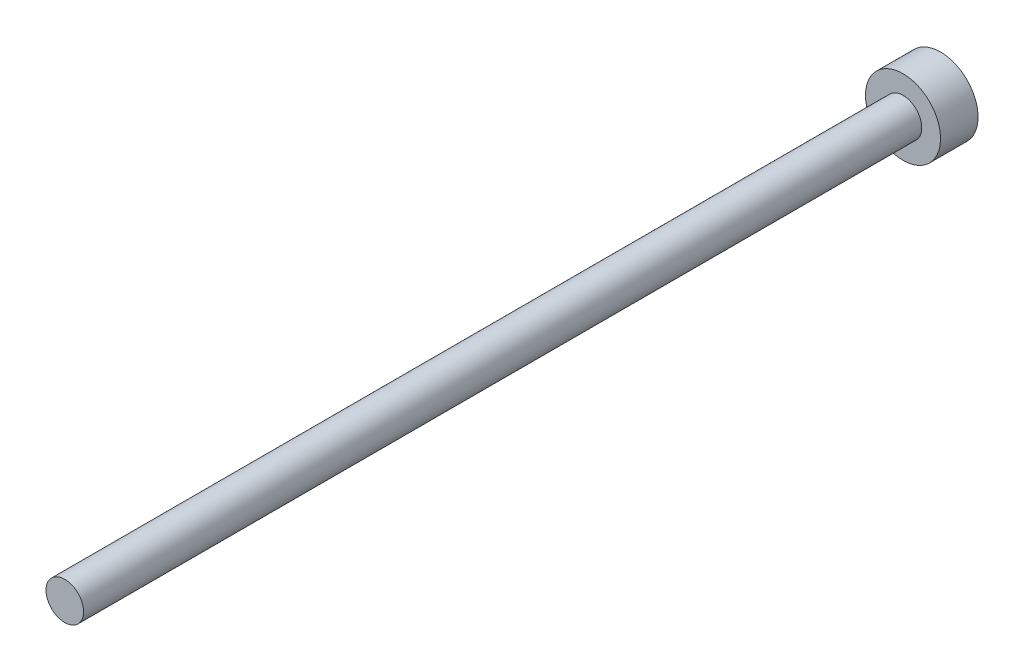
ISO-10303-21;
HEADER;
FILE_DESCRIPTION(('STEP AP214'),'2;1');
FILE_NAME('part.step','',(''),(''),'','','');
FILE_SCHEMA(('AUTOMOTIVE_DESIGN { 1 0 10303 214 1 1 1 1 }'));
ENDSEC;
DATA;
#1=APPLICATION_CONTEXT('core data for automotive mechanical design processes');
#2=APPLICATION_PROTOCOL_DEFINITION('international standard','automotive_design',2000,#1);
#3=PRODUCT_CONTEXT('',#1,'mechanical');
#4=PRODUCT('Part','Part','',(#3));
#5=PRODUCT_RELATED_PRODUCT_CATEGORY('part','',(#4));
#6=PRODUCT_DEFINITION_FORMATION('','',#4);
#7=PRODUCT_DEFINITION_CONTEXT('part definition',#1,'design');
#8=PRODUCT_DEFINITION('design','',#6,#7);
#9=PRODUCT_DEFINITION_SHAPE('','',#8);
#10=(LENGTH_UNIT() NAMED_UNIT(*) SI_UNIT(.MILLI.,.METRE.));
#11=(NAMED_UNIT(*) PLANE_ANGLE_UNIT() SI_UNIT($,.RADIAN.));
#12=(NAMED_UNIT(*) SI_UNIT($,.STERADIAN.) SOLID_ANGLE_UNIT());
#13=UNCERTAINTY_MEASURE_WITH_UNIT(LENGTH_MEASURE(1.E-05),#10,'distance_accuracy_value','');
#14=(GEOMETRIC_REPRESENTATION_CONTEXT(3) GLOBAL_UNCERTAINTY_ASSIGNED_CONTEXT((#13)) GLOBAL_UNIT_ASSIGNED_CONTEXT((#10,
#11,#12)) REPRESENTATION_CONTEXT('',''));
#15=CARTESIAN_POINT('',(0.,0.,0.));
#16=DIRECTION('',(0.,0.,1.));
#17=DIRECTION('',(1.,0.,0.));
#18=AXIS2_PLACEMENT_3D('',#15,#16,#17);
#19=CARTESIAN_POINT('',(0.,0.,3.));
#20=DIRECTION('',(0.,0.,0.999999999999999));
#21=DIRECTION('',(1.,0.,0.));
#22=AXIS2_PLACEMENT_3D('',#19,#20,#21);
#23=PLANE('',#22);
#24=CARTESIAN_POINT('',(0.,0.,3.));
#25=DIRECTION('',(0.,0.,0.999999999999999));
#26=DIRECTION('',(1.,0.,0.));
#27=AXIS2_PLACEMENT_3D('',#24,#25,#26);
#28=CIRCLE('',#27,3.);
#29=CARTESIAN_POINT('',(-3.,0.,3.));
#30=VERTEX_POINT('',#29);
#31=EDGE_CURVE('E10',#30,#30,#28,.T.);
#32=ORIENTED_EDGE('',*,*,#31,.T.);
#33=EDGE_LOOP('',(#32));
#34=FACE_BOUND('',#33,.T.);
#35=CARTESIAN_POINT('',(0.,0.,3.));
#36=DIRECTION('',(0.,0.,0.999999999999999));
#37=DIRECTION('',(1.,0.,0.));
#38=AXIS2_PLACEMENT_3D('',#35,#36,#37);
#39=CIRCLE('',#38,1.5);
#40=CARTESIAN_POINT('',(-1.50000000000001,0.,3.));
#41=VERTEX_POINT('',#40);
#42=EDGE_CURVE('E52',#41,#41,#39,.T.);
#43=ORIENTED_EDGE('',*,*,#42,.F.);
#44=EDGE_LOOP('',(#43));
#45=FACE_BOUND('',#44,.T.);
#46=ADVANCED_FACE('F36',(#34,#45),#23,.T.);
#47=CARTESIAN_POINT('',(0.,0.,3.));
#48=DIRECTION('',(0.,0.,-0.999999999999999));
#49=DIRECTION('',(-1.,0.,0.));
#50=AXIS2_PLACEMENT_3D('',#47,#48,#49);
#51=CYLINDRICAL_SURFACE('',#50,3.);
#52=CARTESIAN_POINT('',(0.,0.,0.));
#53=DIRECTION('',(0.,0.,0.999999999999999));
#54=DIRECTION('',(1.,0.,0.));
#55=AXIS2_PLACEMENT_3D('',#52,#53,#54);
#56=CIRCLE('',#55,3.);
#57=CARTESIAN_POINT('',(-3.,0.,0.));
#58=VERTEX_POINT('',#57);
#59=EDGE_CURVE('E40',#58,#58,#56,.T.);
#60=CARTESIAN_POINT('',(-3.,0.,3.));
#61=CARTESIAN_POINT('',(-3.,0.,2.96875));
#62=CARTESIAN_POINT('',(-3.,0.,2.9375));
#63=CARTESIAN_POINT('',(-3.,0.,2.875));
#64=CARTESIAN_POINT('',(-3.,0.,2.84375));
#65=CARTESIAN_POINT('',(-3.,0.,2.78125));
#66=CARTESIAN_POINT('',(-3.,0.,2.75));
#67=CARTESIAN_POINT('',(-3.,0.,2.6875));
#68=CARTESIAN_POINT('',(-3.,0.,2.65625));
#69=CARTESIAN_POINT('',(-3.,0.,2.59375));
#70=CARTESIAN_POINT('',(-3.,0.,2.5625));
#71=CARTESIAN_POINT('',(-3.,0.,2.5));
#72=CARTESIAN_POINT('',(-3.,0.,2.46875));
#73=CARTESIAN_POINT('',(-3.,0.,2.40625));
#74=CARTESIAN_POINT('',(-3.,0.,2.375));
#75=CARTESIAN_POINT('',(-3.,0.,2.3125));
#76=CARTESIAN_POINT('',(-3.,0.,2.28125));
#77=CARTESIAN_POINT('',(-3.,0.,2.21875));
#78=CARTESIAN_POINT('',(-3.,0.,2.1875));
#79=CARTESIAN_POINT('',(-3.,0.,2.125));
#80=CARTESIAN_POINT('',(-3.,0.,2.09375));
#81=CARTESIAN_POINT('',(-3.,0.,2.03125));
#82=CARTESIAN_POINT('',(-3.,0.,2.));
#83=CARTESIAN_POINT('',(-3.,0.,1.9375));
#84=CARTESIAN_POINT('',(-3.,0.,1.90625));
#85=CARTESIAN_POINT('',(-3.,0.,1.84375));
#86=CARTESIAN_POINT('',(-3.,0.,1.8125));
#87=CARTESIAN_POINT('',(-3.,0.,1.75));
#88=CARTESIAN_POINT('',(-3.,0.,1.71875));
#89=CARTESIAN_POINT('',(-3.,0.,1.65625));
#90=CARTESIAN_POINT('',(-3.,0.,1.625));
#91=CARTESIAN_POINT('',(-3.,0.,1.5625));
#92=CARTESIAN_POINT('',(-3.,0.,1.53125));
#93=CARTESIAN_POINT('',(-3.,0.,1.46875));
#94=CARTESIAN_POINT('',(-3.,0.,1.4375));
#95=CARTESIAN_POINT('',(-3.,0.,1.375));
#96=CARTESIAN_POINT('',(-3.,0.,1.34375));
#97=CARTESIAN_POINT('',(-3.,0.,1.28125));
#98=CARTESIAN_POINT('',(-3.,0.,1.25));
#99=CARTESIAN_POINT('',(-3.,0.,1.1875));
#100=CARTESIAN_POINT('',(-3.,0.,1.15625));
#101=CARTESIAN_POINT('',(-3.,0.,1.09375));
#102=CARTESIAN_POINT('',(-3.,0.,1.0625));
#103=CARTESIAN_POINT('',(-3.,0.,1.));
#104=CARTESIAN_POINT('',(-3.,0.,0.96875));
#105=CARTESIAN_POINT('',(-3.,0.,0.90625));
#106=CARTESIAN_POINT('',(-3.,0.,0.875));
#107=CARTESIAN_POINT('',(-3.,0.,0.8125));
#108=CARTESIAN_POINT('',(-3.,0.,0.78125));
#109=CARTESIAN_POINT('',(-3.,0.,0.71875));
#110=CARTESIAN_POINT('',(-3.,0.,0.6875));
#111=CARTESIAN_POINT('',(-3.,0.,0.625));
#112=CARTESIAN_POINT('',(-3.,0.,0.59375));
#113=CARTESIAN_POINT('',(-3.,0.,0.53125));
#114=CARTESIAN_POINT('',(-3.,0.,0.5));
#115=CARTESIAN_POINT('',(-3.,0.,0.4375));
#116=CARTESIAN_POINT('',(-3.,0.,0.40625));
#117=CARTESIAN_POINT('',(-3.,0.,0.343749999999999));
#118=CARTESIAN_POINT('',(-3.,0.,0.312499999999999));
#119=CARTESIAN_POINT('',(-3.,0.,0.25));
#120=CARTESIAN_POINT('',(-3.,0.,0.21875));
#121=CARTESIAN_POINT('',(-3.,0.,0.15625));
#122=CARTESIAN_POINT('',(-3.,0.,0.124999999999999));
#123=CARTESIAN_POINT('',(-3.,0.,0.0624999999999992));
#124=CARTESIAN_POINT('',(-3.,0.,0.0312499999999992));
#125=CARTESIAN_POINT('',(-3.,0.,0.));
#126=B_SPLINE_CURVE_WITH_KNOTS('',3,(#60,#61,#62,#63,#64,#65,#66,#67,#68,#69,#70,#71,#72,#73,
#74,#75,#76,#77,#78,#79,#80,#81,#82,#83,#84,#85,#86,#87,#88,#89,#90,#91,#92,#93,#94,#95,#96,#97,
#98,#99,#100,#101,#102,#103,#104,#105,#106,#107,#108,#109,#110,#111,#112,#113,#114,#115,#116,
#117,#118,#119,#120,#121,#122,#123,#124,#125),.UNSPECIFIED.,.F.,.F.,(4,2,2,2,2,2,2,2,2,2,2,2,2,
2,2,2,2,2,2,2,2,2,2,2,2,2,2,2,2,2,2,2,4),(0.,0.0937500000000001,0.1875,0.28125,0.375,0.46875,
0.5625,0.656250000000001,0.750000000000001,0.843750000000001,0.937500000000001,1.03125,1.125,
1.21875,1.3125,1.40625,1.5,1.59375,1.6875,1.78125,1.875,1.96875,2.0625,2.15625,2.25,2.34375,
2.4375,2.53125,2.625,2.71875,2.8125,2.90625,3.),.UNSPECIFIED.);
#127=EDGE_CURVE('BSEAM38',#30,#58,#126,.T.);
#128=ORIENTED_EDGE('',*,*,#31,.F.);
#129=ORIENTED_EDGE('',*,*,#59,.T.);
#130=ORIENTED_EDGE('',*,*,#127,.T.);
#131=ORIENTED_EDGE('',*,*,#127,.F.);
#132=EDGE_LOOP('',(#128,#130,#129,#131));
#133=FACE_BOUND('',#132,.T.);
#134=ADVANCED_FACE('F38',(#133),#51,.T.);
#135=CARTESIAN_POINT('',(0.,0.,0.));
#136=DIRECTION('',(0.,0.,0.999999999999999));
#137=DIRECTION('',(1.,0.,0.));
#138=AXIS2_PLACEMENT_3D('',#135,#136,#137);
#139=PLANE('',#138);
#140=ORIENTED_EDGE('',*,*,#59,.F.);
#141=EDGE_LOOP('',(#140));
#142=FACE_BOUND('',#141,.T.);
#143=ADVANCED_FACE('F64',(#142),#139,.F.);
#144=CARTESIAN_POINT('',(0.,0.,69.9999999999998));
#145=DIRECTION('',(0.,0.,-0.999999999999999));
#146=DIRECTION('',(-1.,0.,0.));
#147=AXIS2_PLACEMENT_3D('',#144,#145,#146);
#148=CYLINDRICAL_SURFACE('',#147,1.5);
#149=CARTESIAN_POINT('',(0.,0.,69.9999999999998));
#150=DIRECTION('',(0.,0.,0.999999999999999));
#151=DIRECTION('',(1.,0.,0.));
#152=AXIS2_PLACEMENT_3D('',#149,#150,#151);
#153=CIRCLE('',#152,1.5);
#154=CARTESIAN_POINT('',(-1.50000000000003,0.,69.9999999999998));
#155=VERTEX_POINT('',#154);
#156=EDGE_CURVE('E50',#155,#155,#153,.T.);
#157=CARTESIAN_POINT('',(-1.50000000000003,0.,69.9999999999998));
#158=CARTESIAN_POINT('',(-1.50000000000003,0.,69.3020833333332));
#159=CARTESIAN_POINT('',(-1.50000000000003,0.,68.6041666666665));
#160=CARTESIAN_POINT('',(-1.50000000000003,0.,67.2083333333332));
#161=CARTESIAN_POINT('',(-1.50000000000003,0.,66.5104166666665));
#162=CARTESIAN_POINT('',(-1.50000000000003,0.,65.1145833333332));
#163=CARTESIAN_POINT('',(-1.50000000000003,0.,64.4166666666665));
#164=CARTESIAN_POINT('',(-1.50000000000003,0.,63.0208333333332));
#165=CARTESIAN_POINT('',(-1.50000000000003,0.,62.3229166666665));
#166=CARTESIAN_POINT('',(-1.50000000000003,0.,60.9270833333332));
#167=CARTESIAN_POINT('',(-1.50000000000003,0.,60.2291666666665));
#168=CARTESIAN_POINT('',(-1.50000000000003,0.,58.8333333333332));
#169=CARTESIAN_POINT('',(-1.50000000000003,0.,58.1354166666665));
#170=CARTESIAN_POINT('',(-1.50000000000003,0.,56.7395833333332));
#171=CARTESIAN_POINT('',(-1.50000000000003,0.,56.0416666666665));
#172=CARTESIAN_POINT('',(-1.50000000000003,0.,54.6458333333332));
#173=CARTESIAN_POINT('',(-1.50000000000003,0.,53.9479166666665));
#174=CARTESIAN_POINT('',(-1.50000000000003,0.,52.5520833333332));
#175=CARTESIAN_POINT('',(-1.50000000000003,0.,51.8541666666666));
#176=CARTESIAN_POINT('',(-1.50000000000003,0.,50.4583333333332));
#177=CARTESIAN_POINT('',(-1.50000000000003,0.,49.7604166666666));
#178=CARTESIAN_POINT('',(-1.50000000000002,0.,48.3645833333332));
#179=CARTESIAN_POINT('',(-1.50000000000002,0.,47.6666666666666));
#180=CARTESIAN_POINT('',(-1.50000000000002,0.,46.2708333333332));
#181=CARTESIAN_POINT('',(-1.50000000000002,0.,45.5729166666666));
#182=CARTESIAN_POINT('',(-1.50000000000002,0.,44.1770833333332));
#183=CARTESIAN_POINT('',(-1.50000000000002,0.,43.4791666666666));
#184=CARTESIAN_POINT('',(-1.50000000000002,0.,42.0833333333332));
#185=CARTESIAN_POINT('',(-1.50000000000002,0.,41.3854166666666));
#186=CARTESIAN_POINT('',(-1.50000000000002,0.,39.9895833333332));
#187=CARTESIAN_POINT('',(-1.50000000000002,0.,39.2916666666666));
#188=CARTESIAN_POINT('',(-1.50000000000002,0.,37.8958333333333));
#189=CARTESIAN_POINT('',(-1.50000000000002,0.,37.1979166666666));
#190=CARTESIAN_POINT('',(-1.50000000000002,0.,35.8020833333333));
#191=CARTESIAN_POINT('',(-1.50000000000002,0.,35.1041666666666));
#192=CARTESIAN_POINT('',(-1.50000000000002,0.,33.7083333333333));
#193=CARTESIAN_POINT('',(-1.50000000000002,0.,33.0104166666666));
#194=CARTESIAN_POINT('',(-1.50000000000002,0.,31.6145833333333));
#195=CARTESIAN_POINT('',(-1.50000000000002,0.,30.9166666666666));
#196=CARTESIAN_POINT('',(-1.50000000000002,0.,29.5208333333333));
#197=CARTESIAN_POINT('',(-1.50000000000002,0.,28.8229166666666));
#198=CARTESIAN_POINT('',(-1.50000000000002,0.,27.4270833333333));
#199=CARTESIAN_POINT('',(-1.50000000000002,0.,26.7291666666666));
#200=CARTESIAN_POINT('',(-1.50000000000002,0.,25.3333333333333));
#201=CARTESIAN_POINT('',(-1.50000000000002,0.,24.6354166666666));
#202=CARTESIAN_POINT('',(-1.50000000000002,0.,23.2395833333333));
#203=CARTESIAN_POINT('',(-1.50000000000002,0.,22.5416666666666));
#204=CARTESIAN_POINT('',(-1.50000000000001,0.,21.1458333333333));
#205=CARTESIAN_POINT('',(-1.50000000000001,0.,20.4479166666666));
#206=CARTESIAN_POINT('',(-1.50000000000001,0.,19.0520833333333));
#207=CARTESIAN_POINT('',(-1.50000000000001,0.,18.3541666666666));
#208=CARTESIAN_POINT('',(-1.50000000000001,0.,16.9583333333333));
#209=CARTESIAN_POINT('',(-1.50000000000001,0.,16.2604166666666));
#210=CARTESIAN_POINT('',(-1.50000000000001,0.,14.8645833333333));
#211=CARTESIAN_POINT('',(-1.50000000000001,0.,14.1666666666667));
#212=CARTESIAN_POINT('',(-1.50000000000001,0.,12.7708333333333));
#213=CARTESIAN_POINT('',(-1.50000000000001,0.,12.0729166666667));
#214=CARTESIAN_POINT('',(-1.50000000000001,0.,10.6770833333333));
#215=CARTESIAN_POINT('',(-1.50000000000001,0.,9.97916666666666));
#216=CARTESIAN_POINT('',(-1.50000000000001,0.,8.58333333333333));
#217=CARTESIAN_POINT('',(-1.50000000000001,0.,7.88541666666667));
#218=CARTESIAN_POINT('',(-1.50000000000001,0.,6.48958333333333));
#219=CARTESIAN_POINT('',(-1.50000000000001,0.,5.79166666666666));
#220=CARTESIAN_POINT('',(-1.50000000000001,0.,4.39583333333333));
#221=CARTESIAN_POINT('',(-1.50000000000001,0.,3.69791666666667));
#222=CARTESIAN_POINT('',(-1.50000000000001,0.,3.));
#223=B_SPLINE_CURVE_WITH_KNOTS('',3,(#157,#158,#159,#160,#161,#162,#163,#164,#165,#166,#167,
#168,#169,#170,#171,#172,#173,#174,#175,#176,#177,#178,#179,#180,#181,#182,#183,#184,#185,#186,
#187,#188,#189,#190,#191,#192,#193,#194,#195,#196,#197,#198,#199,#200,#201,#202,#203,#204,#205,
#206,#207,#208,#209,#210,#211,#212,#213,#214,#215,#216,#217,#218,#219,#220,#221,#222),
.UNSPECIFIED.,.F.,.F.,(4,2,2,2,2,2,2,2,2,2,2,2,2,2,2,2,2,2,2,2,2,2,2,2,2,2,2,2,2,2,2,2,4),(0.,
2.09374999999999,4.18749999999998,6.28124999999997,8.37499999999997,10.46875,12.5625,14.65625,
16.7499999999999,18.8437499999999,20.9374999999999,23.0312499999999,25.1249999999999,
27.2187499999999,29.3124999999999,31.4062499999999,33.4999999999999,35.5937499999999,
37.6874999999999,39.7812499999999,41.8749999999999,43.9687499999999,46.0624999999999,
48.1562499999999,50.2499999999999,52.3437499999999,54.4374999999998,56.5312499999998,
58.6249999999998,60.7187499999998,62.8124999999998,64.9062499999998,66.9999999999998),.UNSPECIFIED.);
#224=EDGE_CURVE('BSEAM61',#155,#41,#223,.T.);
#225=ORIENTED_EDGE('',*,*,#156,.F.);
#226=ORIENTED_EDGE('',*,*,#42,.T.);
#227=ORIENTED_EDGE('',*,*,#224,.T.);
#228=ORIENTED_EDGE('',*,*,#224,.F.);
#229=EDGE_LOOP('',(#225,#227,#226,#228));
#230=FACE_BOUND('',#229,.T.);
#231=ADVANCED_FACE('F61',(#230),#148,.T.);
#232=CARTESIAN_POINT('',(0.,0.,69.9999999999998));
#233=DIRECTION('',(0.,0.,0.999999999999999));
#234=DIRECTION('',(1.,0.,0.));
#235=AXIS2_PLACEMENT_3D('',#232,#233,#234);
#236=PLANE('',#235);
#237=ORIENTED_EDGE('',*,*,#156,.T.);
#238=EDGE_LOOP('',(#237));
#239=FACE_BOUND('',#238,.T.);
#240=ADVANCED_FACE('F59',(#239),#236,.T.);
#241=CLOSED_SHELL('',(#46,#134,#143,#231,#240));
#242=MANIFOLD_SOLID_BREP('B2',#241);
#243=ADVANCED_BREP_SHAPE_REPRESENTATION('',(#18,#242),#14);
#244=SHAPE_DEFINITION_REPRESENTATION(#9,#243);
ENDSEC;
END-ISO-10303-21;
